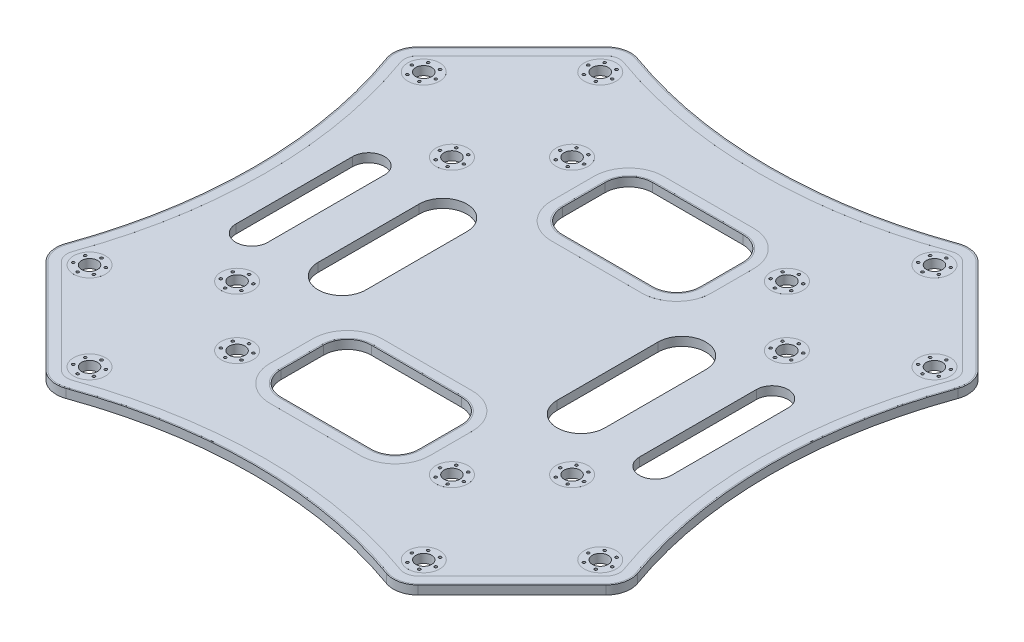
from build123d import *

# Parameters (mm, degrees)
BOSS_EXTRUDE1_DEPTH      = 0.825
BOSS_EXTRUDE1_DEPTH_BACK = 0.825
CUT_EXTRUDE1_DEPTH       = 1.65
SKETCH3_R                = 1.5
CUT_EXTRUDE2_DEPTH       = 1.65
BOSS_EXTRUDE2_START      = 0.001
SKETCH4_R                = 3
SKETCH4_R_2              = 0.25
SKETCH4_R_3              = 1.5
BOSS_EXTRUDE2_DEPTH      = 0.001
SKETCH5_R                = 0.25
CUT_EXTRUDE3_DEPTH       = 1.65


with BuildPart() as part:
    # Sketch1 → Boss-Extrude1 (new, two sides: drawn at the far end of the back side and taken through both)
    with BuildSketch(Plane(origin=(0, 0, 0), x_dir=(1, 0, 0), z_dir=(0, 1, 0)).offset(-BOSS_EXTRUDE1_DEPTH_BACK)):
        with BuildLine():
            Line((35.046361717, 52.705589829), (52.705589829, 35.046361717))
            ThreePointArc((52.705589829, 35.046361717), (53.961944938, 32.762265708), (53.8, 30.160478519))
            ThreePointArc((53.8, 30.160478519), (48.55, 0), (53.8, -30.160478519))
            ThreePointArc((53.8, -30.160478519), (53.961944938, -32.762265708), (52.705589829, -35.046361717))
            Line((52.705589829, -35.046361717), (35.046361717, -52.705589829))
            ThreePointArc((35.046361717, -52.705589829), (32.762265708, -53.961944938), (30.160478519, -53.8))
            ThreePointArc((30.160478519, -53.8), (0, -48.55), (-30.160478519, -53.8))
            ThreePointArc((-30.160478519, -53.8), (-32.762265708, -53.961944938), (-35.046361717, -52.705589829))
            Line((-35.046361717, -52.705589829), (-52.705589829, -35.046361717))
            ThreePointArc((-52.705589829, -35.046361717), (-53.961944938, -32.762265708), (-53.8, -30.160478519))
            ThreePointArc((-53.8, -30.160478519), (-48.55, 0), (-53.8, 30.160478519))
            ThreePointArc((-53.8, 30.160478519), (-53.961944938, 32.762265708), (-52.705589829, 35.046361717))
            Line((-52.705589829, 35.046361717), (-35.046361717, 52.705589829))
            ThreePointArc((-35.046361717, 52.705589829), (-32.762265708, 53.961944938), (-30.160478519, 53.8))
            ThreePointArc((-30.160478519, 53.8), (0, 48.55), (30.160478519, 53.8))
            ThreePointArc((30.160478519, 53.8), (32.762265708, 53.961944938), (35.046361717, 52.705589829))
        make_face()
    extrude(amount=BOSS_EXTRUDE1_DEPTH + BOSS_EXTRUDE1_DEPTH_BACK)

    # Sketch2 → Cut-Extrude1 (cut)
    with BuildSketch(Plane(origin=(0, 0.825, 0), x_dir=(1, 0, 0), z_dir=(0, 1, 0))):
        with BuildLine():
            Line((13, 30.5), (13, 22.5))
            ThreePointArc((13, 22.5), (11.681980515, 19.318019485), (8.5, 18))
            Line((8.5, 18), (-8.5, 18))
            ThreePointArc((-8.5, 18), (-11.681980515, 19.318019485), (-13, 22.5))
            Line((-13, 22.5), (-13, 30.5))
            ThreePointArc((-13, 30.5), (-11.681980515, 33.681980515), (-8.5, 35))
            Line((-8.5, 35), (8.5, 35))
            ThreePointArc((8.5, 35), (11.681980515, 33.681980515), (13, 30.5))
        make_face()
        with BuildLine():
            Line((-13, -22.5), (-13, -30.5))
            ThreePointArc((-13, -30.5), (-11.681980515, -33.681980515), (-8.5, -35))
            Line((-8.5, -35), (8.5, -35))
            ThreePointArc((8.5, -35), (11.681980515, -33.681980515), (13, -30.5))
            Line((13, -30.5), (13, -22.5))
            ThreePointArc((13, -22.5), (11.681980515, -19.318019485), (8.5, -18))
            Line((8.5, -18), (-8.5, -18))
            ThreePointArc((-8.5, -18), (-11.681980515, -19.318019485), (-13, -22.5))
        make_face()
        with BuildLine():
            Line((-27, -9.5), (-27, 9.5))
            ThreePointArc((-27, 9.5), (-22.5, 14), (-18, 9.5))
            Line((-18, 9.5), (-18, -9.5))
            ThreePointArc((-18, -9.5), (-22.5, -14), (-27, -9.5))
        make_face()
        with BuildLine():
            Line((18, -9.5), (18, 9.5))
            ThreePointArc((18, 9.5), (22.5, 14), (27, 9.5))
            Line((27, 9.5), (27, -9.5))
            ThreePointArc((27, -9.5), (22.5, -14), (18, -9.5))
        make_face()
        with BuildLine():
            Line((-35, 11), (-35, -11))
            ThreePointArc((-35, -11), (-38, -14), (-41, -11))
            Line((-41, -11), (-41, 11))
            ThreePointArc((-41, 11), (-38, 14), (-35, 11))
        make_face()
        with BuildLine():
            Line((35, 11), (35, -11))
            ThreePointArc((35, -11), (38, -14), (41, -11))
            Line((41, -11), (41, 11))
            ThreePointArc((41, 11), (38, 14), (35, 11))
        make_face()
    extrude(amount=-CUT_EXTRUDE1_DEPTH, mode=Mode.SUBTRACT)

    # Sketch3 → Cut-Extrude2 (cut)
    with BuildSketch(Plane(origin=(0, 0.825, 0), x_dir=(1, 0, 0), z_dir=(0, 1, 0))):
        with Locations(Location((-48.083261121, -31.466251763, 0), (0, 0, 270))):
            Circle(SKETCH3_R)
        with Locations(Location((-31.466251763, -48.083261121, 0), (0, 0, 270))):
            Circle(SKETCH3_R)
        with Locations(Location((31.466251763, -48.083261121, 0), (0, 0, 270))):
            Circle(SKETCH3_R)
        with Locations(Location((48.083261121, -31.466251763, 0), (0, 0, 270))):
            Circle(SKETCH3_R)
        with Locations(Location((48.083261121, 31.466251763, 0), (0, 0, 270))):
            Circle(SKETCH3_R)
        with Locations(Location((31.466251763, 48.083261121, 0), (0, 0, 270))):
            Circle(SKETCH3_R)
        with Locations(Location((-31.466251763, 48.083261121, 0), (0, 0, 270))):
            Circle(SKETCH3_R)
        with Locations(Location((-48.083261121, 31.466251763, 0), (0, 0, 270))):
            Circle(SKETCH3_R)
        with Locations(Location((-31.540291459, -20.22658296, 0), (0, 0, 270))):
            Circle(SKETCH3_R)
        with Locations(Location((-20.22658296, -31.540291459, 0), (0, 0, 270))):
            Circle(SKETCH3_R)
        with Locations(Location((-31.540291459, 20.22658296, 0), (0, 0, 270))):
            Circle(SKETCH3_R)
        with Locations(Location((-20.22658296, 31.540291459, 0), (0, 0, 270))):
            Circle(SKETCH3_R)
        with Locations(Location((20.22658296, 31.540291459, 0), (0, 0, 270))):
            Circle(SKETCH3_R)
        with Locations(Location((31.540291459, 20.22658296, 0), (0, 0, 270))):
            Circle(SKETCH3_R)
        with Locations(Location((31.540291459, -20.22658296, 0), (0, 0, 270))):
            Circle(SKETCH3_R)
        with Locations(Location((20.22658296, -31.540291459, 0), (0, 0, 270))):
            Circle(SKETCH3_R)
    extrude(amount=-CUT_EXTRUDE2_DEPTH, mode=Mode.SUBTRACT)

    # Sketch4 → Boss-Extrude2 (add)
    # profile 1 of 19: a face of its own
    with BuildSketch(Plane(origin=(0, 0.825, 0), x_dir=(1, 0, 0), z_dir=(0, 1, 0)).offset(BOSS_EXTRUDE2_START)):
        with BuildLine():
            ThreePointArc((30.244953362, -53.564704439), (32.707621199, -53.71799007), (34.869585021, -52.528813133))
            Line((34.869585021, -52.528813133), (52.528813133, -34.869585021))
            ThreePointArc((52.528813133, -34.869585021), (53.71799007, -32.707621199), (53.564704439, -30.244953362))
            ThreePointArc((53.564704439, -30.244953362), (48.3, 0), (53.564704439, 30.244953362))
            ThreePointArc((53.564704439, 30.244953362), (53.71799007, 32.707621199), (52.528813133, 34.869585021))
            Line((52.528813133, 34.869585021), (34.869585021, 52.528813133))
            ThreePointArc((34.869585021, 52.528813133), (32.707621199, 53.71799007), (30.244953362, 53.564704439))
            ThreePointArc((30.244953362, 53.564704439), (0, 48.3), (-30.244953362, 53.564704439))
            ThreePointArc((-30.244953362, 53.564704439), (-32.707621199, 53.71799007), (-34.869585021, 52.528813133))
            Line((-34.869585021, 52.528813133), (-52.528813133, 34.869585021))
            ThreePointArc((-52.528813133, 34.869585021), (-53.71799007, 32.707621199), (-53.564704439, 30.244953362))
            ThreePointArc((-53.564704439, 30.244953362), (-48.3, 0), (-53.564704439, -30.244953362))
            ThreePointArc((-53.564704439, -30.244953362), (-53.71799007, -32.707621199), (-52.528813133, -34.869585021))
            Line((-52.528813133, -34.869585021), (-34.869585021, -52.528813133))
            ThreePointArc((-34.869585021, -52.528813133), (-32.707621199, -53.71799007), (-30.244953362, -53.564704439))
            ThreePointArc((-30.244953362, -53.564704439), (0, -48.3), (30.244953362, -53.564704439))
        make_face()
        with BuildLine():
            ThreePointArc((-51.870576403, 30.853172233), (-51.961515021, 32.314180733), (-51.256020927, 33.596792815))
            Line((-51.256020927, 33.596792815), (-33.596792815, 51.256020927))
            ThreePointArc((-33.596792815, 51.256020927), (-32.314180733, 51.961515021), (-30.853172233, 51.870576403))
            ThreePointArc((-30.853172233, 51.870576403), (0, 46.5), (30.853172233, 51.870576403))
            ThreePointArc((30.853172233, 51.870576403), (32.314180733, 51.961515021), (33.596792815, 51.256020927))
            Line((33.596792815, 51.256020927), (51.256020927, 33.596792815))
            ThreePointArc((51.256020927, 33.596792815), (51.961515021, 32.314180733), (51.870576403, 30.853172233))
            ThreePointArc((51.870576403, 30.853172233), (46.5, 0), (51.870576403, -30.853172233))
            ThreePointArc((51.870576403, -30.853172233), (51.961515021, -32.314180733), (51.256020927, -33.596792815))
            Line((51.256020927, -33.596792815), (33.596792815, -51.256020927))
            ThreePointArc((33.596792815, -51.256020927), (32.314180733, -51.961515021), (30.853172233, -51.870576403))
            ThreePointArc((30.853172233, -51.870576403), (0, -46.5), (-30.853172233, -51.870576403))
            ThreePointArc((-30.853172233, -51.870576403), (-32.314180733, -51.961515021), (-33.596792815, -51.256020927))
            Line((-33.596792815, -51.256020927), (-51.256020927, -33.596792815))
            ThreePointArc((-51.256020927, -33.596792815), (-51.961515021, -32.314180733), (-51.870576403, -30.853172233))
            ThreePointArc((-51.870576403, -30.853172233), (-46.5, 0), (-51.870576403, 30.853172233))
        make_face(mode=Mode.SUBTRACT)
    # profile 2 of 19: a face of its own
    with BuildSketch(Plane(origin=(0, 0.825, 0), x_dir=(1, 0, 0), z_dir=(0, 1, 0)).offset(BOSS_EXTRUDE2_START)):
        with BuildLine():
            Line((15.05, 22.5), (15.05, 30.5))
            ThreePointArc((15.05, 30.5), (13.131549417, 35.131549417), (8.5, 37.05))
            Line((8.5, 37.05), (-8.5, 37.05))
            ThreePointArc((-8.5, 37.05), (-13.131549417, 35.131549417), (-15.05, 30.5))
            Line((-15.05, 30.5), (-15.05, 22.5))
            ThreePointArc((-15.05, 22.5), (-13.131549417, 17.868450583), (-8.5, 15.95))
            Line((-8.5, 15.95), (8.5, 15.95))
            ThreePointArc((8.5, 15.95), (13.131549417, 17.868450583), (15.05, 22.5))
        make_face()
        with BuildLine():
            Line((8.5, 17.75), (-8.5, 17.75))
            ThreePointArc((-8.5, 17.75), (-11.858757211, 19.141242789), (-13.25, 22.5))
            Line((-13.25, 22.5), (-13.25, 30.5))
            ThreePointArc((-13.25, 30.5), (-11.858757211, 33.858757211), (-8.5, 35.25))
            Line((-8.5, 35.25), (8.5, 35.25))
            ThreePointArc((8.5, 35.25), (11.858757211, 33.858757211), (13.25, 30.5))
            Line((13.25, 30.5), (13.25, 22.5))
            ThreePointArc((13.25, 22.5), (11.858757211, 19.141242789), (8.5, 17.75))
        make_face(mode=Mode.SUBTRACT)
    # profile 3 of 19: a face of its own
    with BuildSketch(Plane(origin=(0, 0.825, 0), x_dir=(1, 0, 0), z_dir=(0, 1, 0)).offset(BOSS_EXTRUDE2_START)):
        with BuildLine():
            ThreePointArc((8.5, -37.05), (13.131549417, -35.131549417), (15.05, -30.5))
            Line((15.05, -30.5), (15.05, -22.5))
            ThreePointArc((15.05, -22.5), (13.131549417, -17.868450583), (8.5, -15.95))
            Line((8.5, -15.95), (-8.5, -15.95))
            ThreePointArc((-8.5, -15.95), (-13.131549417, -17.868450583), (-15.05, -22.5))
            Line((-15.05, -22.5), (-15.05, -30.5))
            ThreePointArc((-15.05, -30.5), (-13.131549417, -35.131549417), (-8.5, -37.05))
            Line((-8.5, -37.05), (8.5, -37.05))
        make_face()
        with BuildLine():
            Line((13.25, -22.5), (13.25, -30.5))
            ThreePointArc((13.25, -30.5), (11.858757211, -33.858757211), (8.5, -35.25))
            Line((8.5, -35.25), (-8.5, -35.25))
            ThreePointArc((-8.5, -35.25), (-11.858757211, -33.858757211), (-13.25, -30.5))
            Line((-13.25, -30.5), (-13.25, -22.5))
            ThreePointArc((-13.25, -22.5), (-11.858757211, -19.141242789), (-8.5, -17.75))
            Line((-8.5, -17.75), (8.5, -17.75))
            ThreePointArc((8.5, -17.75), (11.858757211, -19.141242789), (13.25, -22.5))
        make_face(mode=Mode.SUBTRACT)
    # profile 4 of 19: a face of its own
    with BuildSketch(Plane(origin=(0, 0.825, 0), x_dir=(1, 0, 0), z_dir=(0, 1, 0)).offset(BOSS_EXTRUDE2_START)):
        with Locations(Location((-31.466251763, -48.083261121, 0), (0, 0, 270))):
            Circle(SKETCH4_R)
        with Locations(Location((-33.414808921, -49.208261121, 0), (0, 0, 270))):
            Circle(SKETCH4_R_2, mode=Mode.SUBTRACT)
        with Locations(Location((-31.466251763, -50.333261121, 0), (0, 0, 270))):
            Circle(SKETCH4_R_2, mode=Mode.SUBTRACT)
        with Locations(Location((-31.466251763, -48.083261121, 0), (0, 0, 270))):
            Circle(SKETCH4_R_3, mode=Mode.SUBTRACT)
        with Locations(Location((-29.517694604, -49.208261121, 0), (0, 0, 270))):
            Circle(SKETCH4_R_2, mode=Mode.SUBTRACT)
        with Locations(Location((-33.414808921, -46.958261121, 0), (0, 0, 270))):
            Circle(SKETCH4_R_2, mode=Mode.SUBTRACT)
        with Locations(Location((-31.466251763, -45.833261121, 0), (0, 0, 270))):
            Circle(SKETCH4_R_2, mode=Mode.SUBTRACT)
        with Locations(Location((-29.517694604, -46.958261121, 0), (0, 0, 270))):
            Circle(SKETCH4_R_2, mode=Mode.SUBTRACT)
    # profile 5 of 19: a face of its own
    with BuildSketch(Plane(origin=(0, 0.825, 0), x_dir=(1, 0, 0), z_dir=(0, 1, 0)).offset(BOSS_EXTRUDE2_START)):
        with Locations(Location((-48.083261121, -31.466251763, 0), (0, 0, 270))):
            Circle(SKETCH4_R)
        with Locations(Location((-48.083261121, -33.716251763, 0), (0, 0, 270))):
            Circle(SKETCH4_R_2, mode=Mode.SUBTRACT)
        with Locations(Location((-50.031818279, -32.591251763, 0), (0, 0, 270))):
            Circle(SKETCH4_R_2, mode=Mode.SUBTRACT)
        with Locations(Location((-50.031818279, -30.341251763, 0), (0, 0, 270))):
            Circle(SKETCH4_R_2, mode=Mode.SUBTRACT)
        with Locations(Location((-48.083261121, -31.466251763, 0), (0, 0, 270))):
            Circle(SKETCH4_R_3, mode=Mode.SUBTRACT)
        with Locations(Location((-48.083261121, -29.216251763, 0), (0, 0, 270))):
            Circle(SKETCH4_R_2, mode=Mode.SUBTRACT)
        with Locations(Location((-46.134703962, -32.591251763, 0), (0, 0, 270))):
            Circle(SKETCH4_R_2, mode=Mode.SUBTRACT)
        with Locations(Location((-46.134703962, -30.341251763, 0), (0, 0, 270))):
            Circle(SKETCH4_R_2, mode=Mode.SUBTRACT)
    # profile 6 of 19: a face of its own
    with BuildSketch(Plane(origin=(0, 0.825, 0), x_dir=(1, 0, 0), z_dir=(0, 1, 0)).offset(BOSS_EXTRUDE2_START)):
        with Locations(Location((-31.540291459, -20.22658296, 0), (0, 0, 270))):
            Circle(SKETCH4_R)
        with Locations(Location((-31.540291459, -22.47658296, 0), (0, 0, 270))):
            Circle(SKETCH4_R_2, mode=Mode.SUBTRACT)
        with Locations(Location((-33.488848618, -21.35158296, 0), (0, 0, 270))):
            Circle(SKETCH4_R_2, mode=Mode.SUBTRACT)
        with Locations(Location((-31.540291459, -20.22658296, 0), (0, 0, 270))):
            Circle(SKETCH4_R_3, mode=Mode.SUBTRACT)
        with Locations(Location((-29.591734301, -21.35158296, 0), (0, 0, 270))):
            Circle(SKETCH4_R_2, mode=Mode.SUBTRACT)
        with Locations(Location((-33.488848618, -19.10158296, 0), (0, 0, 270))):
            Circle(SKETCH4_R_2, mode=Mode.SUBTRACT)
        with Locations(Location((-31.540291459, -17.97658296, 0), (0, 0, 270))):
            Circle(SKETCH4_R_2, mode=Mode.SUBTRACT)
        with Locations(Location((-29.591734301, -19.10158296, 0), (0, 0, 270))):
            Circle(SKETCH4_R_2, mode=Mode.SUBTRACT)
    # profile 7 of 19: a face of its own
    with BuildSketch(Plane(origin=(0, 0.825, 0), x_dir=(1, 0, 0), z_dir=(0, 1, 0)).offset(BOSS_EXTRUDE2_START)):
        with Locations(Location((-20.22658296, -31.540291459, 0), (0, 0, 270))):
            Circle(SKETCH4_R)
        with Locations(Location((-20.22658296, -33.790291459, 0), (0, 0, 270))):
            Circle(SKETCH4_R_2, mode=Mode.SUBTRACT)
        with Locations(Location((-22.175140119, -32.665291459, 0), (0, 0, 270))):
            Circle(SKETCH4_R_2, mode=Mode.SUBTRACT)
        with Locations(Location((-22.175140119, -30.415291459, 0), (0, 0, 270))):
            Circle(SKETCH4_R_2, mode=Mode.SUBTRACT)
        with Locations(Location((-20.22658296, -31.540291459, 0), (0, 0, 270))):
            Circle(SKETCH4_R_3, mode=Mode.SUBTRACT)
        with Locations(Location((-20.22658296, -29.290291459, 0), (0, 0, 270))):
            Circle(SKETCH4_R_2, mode=Mode.SUBTRACT)
        with Locations(Location((-18.278025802, -32.665291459, 0), (0, 0, 270))):
            Circle(SKETCH4_R_2, mode=Mode.SUBTRACT)
        with Locations(Location((-18.278025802, -30.415291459, 0), (0, 0, 270))):
            Circle(SKETCH4_R_2, mode=Mode.SUBTRACT)
    # profile 8 of 19: a face of its own
    with BuildSketch(Plane(origin=(0, 0.825, 0), x_dir=(1, 0, 0), z_dir=(0, 1, 0)).offset(BOSS_EXTRUDE2_START)):
        with Locations(Location((-48.083261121, 31.466251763, 0), (0, 0, 270))):
            Circle(SKETCH4_R)
        with Locations(Location((-49.208261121, 29.517694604, 0), (0, 0, 270))):
            Circle(SKETCH4_R_2, mode=Mode.SUBTRACT)
        with Locations(Location((-50.333261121, 31.466251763, 0), (0, 0, 270))):
            Circle(SKETCH4_R_2, mode=Mode.SUBTRACT)
        with Locations(Location((-48.083261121, 31.466251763, 0), (0, 0, 270))):
            Circle(SKETCH4_R_3, mode=Mode.SUBTRACT)
        with Locations(Location((-49.208261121, 33.414808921, 0), (0, 0, 270))):
            Circle(SKETCH4_R_2, mode=Mode.SUBTRACT)
        with Locations(Location((-46.958261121, 29.517694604, 0), (0, 0, 270))):
            Circle(SKETCH4_R_2, mode=Mode.SUBTRACT)
        with Locations(Location((-45.833261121, 31.466251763, 0), (0, 0, 270))):
            Circle(SKETCH4_R_2, mode=Mode.SUBTRACT)
        with Locations(Location((-46.958261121, 33.414808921, 0), (0, 0, 270))):
            Circle(SKETCH4_R_2, mode=Mode.SUBTRACT)
    # profile 9 of 19: a face of its own
    with BuildSketch(Plane(origin=(0, 0.825, 0), x_dir=(1, 0, 0), z_dir=(0, 1, 0)).offset(BOSS_EXTRUDE2_START)):
        with Locations(Location((-31.540291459, 20.22658296, 0), (0, 0, 270))):
            Circle(SKETCH4_R)
        with Locations(Location((-32.665291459, 18.278025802, 0), (0, 0, 270))):
            Circle(SKETCH4_R_2, mode=Mode.SUBTRACT)
        with Locations(Location((-30.415291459, 18.278025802, 0), (0, 0, 270))):
            Circle(SKETCH4_R_2, mode=Mode.SUBTRACT)
        with Locations(Location((-33.790291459, 20.22658296, 0), (0, 0, 270))):
            Circle(SKETCH4_R_2, mode=Mode.SUBTRACT)
        with Locations(Location((-31.540291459, 20.22658296, 0), (0, 0, 270))):
            Circle(SKETCH4_R_3, mode=Mode.SUBTRACT)
        with Locations(Location((-32.665291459, 22.175140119, 0), (0, 0, 270))):
            Circle(SKETCH4_R_2, mode=Mode.SUBTRACT)
        with Locations(Location((-30.415291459, 22.175140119, 0), (0, 0, 270))):
            Circle(SKETCH4_R_2, mode=Mode.SUBTRACT)
        with Locations(Location((-29.290291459, 20.22658296, 0), (0, 0, 270))):
            Circle(SKETCH4_R_2, mode=Mode.SUBTRACT)
    # profile 10 of 19: a face of its own
    with BuildSketch(Plane(origin=(0, 0.825, 0), x_dir=(1, 0, 0), z_dir=(0, 1, 0)).offset(BOSS_EXTRUDE2_START)):
        with Locations(Location((-20.22658296, 31.540291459, 0), (0, 0, 270))):
            Circle(SKETCH4_R)
        with Locations(Location((-21.35158296, 29.591734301, 0), (0, 0, 270))):
            Circle(SKETCH4_R_2, mode=Mode.SUBTRACT)
        with Locations(Location((-22.47658296, 31.540291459, 0), (0, 0, 270))):
            Circle(SKETCH4_R_2, mode=Mode.SUBTRACT)
        with Locations(Location((-20.22658296, 31.540291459, 0), (0, 0, 270))):
            Circle(SKETCH4_R_3, mode=Mode.SUBTRACT)
        with Locations(Location((-21.35158296, 33.488848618, 0), (0, 0, 270))):
            Circle(SKETCH4_R_2, mode=Mode.SUBTRACT)
        with Locations(Location((-19.10158296, 29.591734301, 0), (0, 0, 270))):
            Circle(SKETCH4_R_2, mode=Mode.SUBTRACT)
        with Locations(Location((-17.97658296, 31.540291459, 0), (0, 0, 270))):
            Circle(SKETCH4_R_2, mode=Mode.SUBTRACT)
        with Locations(Location((-19.10158296, 33.488848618, 0), (0, 0, 270))):
            Circle(SKETCH4_R_2, mode=Mode.SUBTRACT)
    # profile 11 of 19: a face of its own
    with BuildSketch(Plane(origin=(0, 0.825, 0), x_dir=(1, 0, 0), z_dir=(0, 1, 0)).offset(BOSS_EXTRUDE2_START)):
        with Locations(Location((-31.466251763, 48.083261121, 0), (0, 0, 270))):
            Circle(SKETCH4_R)
        with Locations(Location((-32.591251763, 46.134703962, 0), (0, 0, 270))):
            Circle(SKETCH4_R_2, mode=Mode.SUBTRACT)
        with Locations(Location((-30.341251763, 46.134703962, 0), (0, 0, 270))):
            Circle(SKETCH4_R_2, mode=Mode.SUBTRACT)
        with Locations(Location((-33.716251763, 48.083261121, 0), (0, 0, 270))):
            Circle(SKETCH4_R_2, mode=Mode.SUBTRACT)
        with Locations(Location((-31.466251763, 48.083261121, 0), (0, 0, 270))):
            Circle(SKETCH4_R_3, mode=Mode.SUBTRACT)
        with Locations(Location((-32.591251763, 50.031818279, 0), (0, 0, 270))):
            Circle(SKETCH4_R_2, mode=Mode.SUBTRACT)
        with Locations(Location((-30.341251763, 50.031818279, 0), (0, 0, 270))):
            Circle(SKETCH4_R_2, mode=Mode.SUBTRACT)
        with Locations(Location((-29.216251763, 48.083261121, 0), (0, 0, 270))):
            Circle(SKETCH4_R_2, mode=Mode.SUBTRACT)
    # profile 12 of 19: a face of its own
    with BuildSketch(Plane(origin=(0, 0.825, 0), x_dir=(1, 0, 0), z_dir=(0, 1, 0)).offset(BOSS_EXTRUDE2_START)):
        with Locations(Location((20.22658296, 31.540291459, 0), (0, 0, 270))):
            Circle(SKETCH4_R)
        with Locations(Location((18.278025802, 30.415291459, 0), (0, 0, 270))):
            Circle(SKETCH4_R_2, mode=Mode.SUBTRACT)
        with Locations(Location((18.278025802, 32.665291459, 0), (0, 0, 270))):
            Circle(SKETCH4_R_2, mode=Mode.SUBTRACT)
        with Locations(Location((20.22658296, 29.290291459, 0), (0, 0, 270))):
            Circle(SKETCH4_R_2, mode=Mode.SUBTRACT)
        with Locations(Location((20.22658296, 31.540291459, 0), (0, 0, 270))):
            Circle(SKETCH4_R_3, mode=Mode.SUBTRACT)
        with Locations(Location((22.175140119, 30.415291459, 0), (0, 0, 270))):
            Circle(SKETCH4_R_2, mode=Mode.SUBTRACT)
        with Locations(Location((22.175140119, 32.665291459, 0), (0, 0, 270))):
            Circle(SKETCH4_R_2, mode=Mode.SUBTRACT)
        with Locations(Location((20.22658296, 33.790291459, 0), (0, 0, 270))):
            Circle(SKETCH4_R_2, mode=Mode.SUBTRACT)
    # profile 13 of 19: a face of its own
    with BuildSketch(Plane(origin=(0, 0.825, 0), x_dir=(1, 0, 0), z_dir=(0, 1, 0)).offset(BOSS_EXTRUDE2_START)):
        with Locations(Location((31.466251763, 48.083261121, 0), (0, 0, 270))):
            Circle(SKETCH4_R)
        with Locations(Location((29.517694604, 46.958261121, 0), (0, 0, 270))):
            Circle(SKETCH4_R_2, mode=Mode.SUBTRACT)
        with Locations(Location((31.466251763, 45.833261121, 0), (0, 0, 270))):
            Circle(SKETCH4_R_2, mode=Mode.SUBTRACT)
        with Locations(Location((33.414808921, 46.958261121, 0), (0, 0, 270))):
            Circle(SKETCH4_R_2, mode=Mode.SUBTRACT)
        with Locations(Location((29.517694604, 49.208261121, 0), (0, 0, 270))):
            Circle(SKETCH4_R_2, mode=Mode.SUBTRACT)
        with Locations(Location((31.466251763, 48.083261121, 0), (0, 0, 270))):
            Circle(SKETCH4_R_3, mode=Mode.SUBTRACT)
        with Locations(Location((31.466251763, 50.333261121, 0), (0, 0, 270))):
            Circle(SKETCH4_R_2, mode=Mode.SUBTRACT)
        with Locations(Location((33.414808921, 49.208261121, 0), (0, 0, 270))):
            Circle(SKETCH4_R_2, mode=Mode.SUBTRACT)
    # profile 14 of 19: a face of its own
    with BuildSketch(Plane(origin=(0, 0.825, 0), x_dir=(1, 0, 0), z_dir=(0, 1, 0)).offset(BOSS_EXTRUDE2_START)):
        with Locations(Location((48.083261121, 31.466251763, 0), (0, 0, 270))):
            Circle(SKETCH4_R)
        with Locations(Location((46.134703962, 30.341251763, 0), (0, 0, 270))):
            Circle(SKETCH4_R_2, mode=Mode.SUBTRACT)
        with Locations(Location((46.134703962, 32.591251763, 0), (0, 0, 270))):
            Circle(SKETCH4_R_2, mode=Mode.SUBTRACT)
        with Locations(Location((48.083261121, 29.216251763, 0), (0, 0, 270))):
            Circle(SKETCH4_R_2, mode=Mode.SUBTRACT)
        with Locations(Location((48.083261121, 31.466251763, 0), (0, 0, 270))):
            Circle(SKETCH4_R_3, mode=Mode.SUBTRACT)
        with Locations(Location((50.031818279, 30.341251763, 0), (0, 0, 270))):
            Circle(SKETCH4_R_2, mode=Mode.SUBTRACT)
        with Locations(Location((50.031818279, 32.591251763, 0), (0, 0, 270))):
            Circle(SKETCH4_R_2, mode=Mode.SUBTRACT)
        with Locations(Location((48.083261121, 33.716251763, 0), (0, 0, 270))):
            Circle(SKETCH4_R_2, mode=Mode.SUBTRACT)
    # profile 15 of 19: a face of its own
    with BuildSketch(Plane(origin=(0, 0.825, 0), x_dir=(1, 0, 0), z_dir=(0, 1, 0)).offset(BOSS_EXTRUDE2_START)):
        with Locations(Location((31.540291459, 20.22658296, 0), (0, 0, 270))):
            Circle(SKETCH4_R)
        with Locations(Location((29.591734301, 19.10158296, 0), (0, 0, 270))):
            Circle(SKETCH4_R_2, mode=Mode.SUBTRACT)
        with Locations(Location((31.540291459, 17.97658296, 0), (0, 0, 270))):
            Circle(SKETCH4_R_2, mode=Mode.SUBTRACT)
        with Locations(Location((33.488848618, 19.10158296, 0), (0, 0, 270))):
            Circle(SKETCH4_R_2, mode=Mode.SUBTRACT)
        with Locations(Location((29.591734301, 21.35158296, 0), (0, 0, 270))):
            Circle(SKETCH4_R_2, mode=Mode.SUBTRACT)
        with Locations(Location((31.540291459, 20.22658296, 0), (0, 0, 270))):
            Circle(SKETCH4_R_3, mode=Mode.SUBTRACT)
        with Locations(Location((33.488848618, 21.35158296, 0), (0, 0, 270))):
            Circle(SKETCH4_R_2, mode=Mode.SUBTRACT)
        with Locations(Location((31.540291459, 22.47658296, 0), (0, 0, 270))):
            Circle(SKETCH4_R_2, mode=Mode.SUBTRACT)
    # profile 16 of 19: a face of its own
    with BuildSketch(Plane(origin=(0, 0.825, 0), x_dir=(1, 0, 0), z_dir=(0, 1, 0)).offset(BOSS_EXTRUDE2_START)):
        with Locations(Location((20.22658296, -31.540291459, 0), (0, 0, 270))):
            Circle(SKETCH4_R)
        with Locations(Location((19.10158296, -33.488848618, 0), (0, 0, 270))):
            Circle(SKETCH4_R_2, mode=Mode.SUBTRACT)
        with Locations(Location((17.97658296, -31.540291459, 0), (0, 0, 270))):
            Circle(SKETCH4_R_2, mode=Mode.SUBTRACT)
        with Locations(Location((19.10158296, -29.591734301, 0), (0, 0, 270))):
            Circle(SKETCH4_R_2, mode=Mode.SUBTRACT)
        with Locations(Location((21.35158296, -33.488848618, 0), (0, 0, 270))):
            Circle(SKETCH4_R_2, mode=Mode.SUBTRACT)
        with Locations(Location((20.22658296, -31.540291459, 0), (0, 0, 270))):
            Circle(SKETCH4_R_3, mode=Mode.SUBTRACT)
        with Locations(Location((22.47658296, -31.540291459, 0), (0, 0, 270))):
            Circle(SKETCH4_R_2, mode=Mode.SUBTRACT)
        with Locations(Location((21.35158296, -29.591734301, 0), (0, 0, 270))):
            Circle(SKETCH4_R_2, mode=Mode.SUBTRACT)
    # profile 17 of 19: a face of its own
    with BuildSketch(Plane(origin=(0, 0.825, 0), x_dir=(1, 0, 0), z_dir=(0, 1, 0)).offset(BOSS_EXTRUDE2_START)):
        with Locations(Location((31.540291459, -20.22658296, 0), (0, 0, 270))):
            Circle(SKETCH4_R)
        with Locations(Location((29.290291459, -20.22658296, 0), (0, 0, 270))):
            Circle(SKETCH4_R_2, mode=Mode.SUBTRACT)
        with Locations(Location((30.415291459, -22.175140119, 0), (0, 0, 270))):
            Circle(SKETCH4_R_2, mode=Mode.SUBTRACT)
        with Locations(Location((32.665291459, -22.175140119, 0), (0, 0, 270))):
            Circle(SKETCH4_R_2, mode=Mode.SUBTRACT)
        with Locations(Location((31.540291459, -20.22658296, 0), (0, 0, 270))):
            Circle(SKETCH4_R_3, mode=Mode.SUBTRACT)
        with Locations(Location((33.790291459, -20.22658296, 0), (0, 0, 270))):
            Circle(SKETCH4_R_2, mode=Mode.SUBTRACT)
        with Locations(Location((30.415291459, -18.278025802, 0), (0, 0, 270))):
            Circle(SKETCH4_R_2, mode=Mode.SUBTRACT)
        with Locations(Location((32.665291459, -18.278025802, 0), (0, 0, 270))):
            Circle(SKETCH4_R_2, mode=Mode.SUBTRACT)
    # profile 18 of 19: a face of its own
    with BuildSketch(Plane(origin=(0, 0.825, 0), x_dir=(1, 0, 0), z_dir=(0, 1, 0)).offset(BOSS_EXTRUDE2_START)):
        with Locations(Location((48.083261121, -31.466251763, 0), (0, 0, 270))):
            Circle(SKETCH4_R)
        with Locations(Location((46.958261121, -33.414808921, 0), (0, 0, 270))):
            Circle(SKETCH4_R_2, mode=Mode.SUBTRACT)
        with Locations(Location((45.833261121, -31.466251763, 0), (0, 0, 270))):
            Circle(SKETCH4_R_2, mode=Mode.SUBTRACT)
        with Locations(Location((46.958261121, -29.517694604, 0), (0, 0, 270))):
            Circle(SKETCH4_R_2, mode=Mode.SUBTRACT)
        with Locations(Location((49.208261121, -33.414808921, 0), (0, 0, 270))):
            Circle(SKETCH4_R_2, mode=Mode.SUBTRACT)
        with Locations(Location((48.083261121, -31.466251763, 0), (0, 0, 270))):
            Circle(SKETCH4_R_3, mode=Mode.SUBTRACT)
        with Locations(Location((50.333261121, -31.466251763, 0), (0, 0, 270))):
            Circle(SKETCH4_R_2, mode=Mode.SUBTRACT)
        with Locations(Location((49.208261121, -29.517694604, 0), (0, 0, 270))):
            Circle(SKETCH4_R_2, mode=Mode.SUBTRACT)
    # profile 19 of 19: a face of its own
    with BuildSketch(Plane(origin=(0, 0.825, 0), x_dir=(1, 0, 0), z_dir=(0, 1, 0)).offset(BOSS_EXTRUDE2_START)):
        with Locations(Location((31.466251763, -48.083261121, 0), (0, 0, 270))):
            Circle(SKETCH4_R)
        with Locations(Location((29.216251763, -48.083261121, 0), (0, 0, 270))):
            Circle(SKETCH4_R_2, mode=Mode.SUBTRACT)
        with Locations(Location((30.341251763, -50.031818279, 0), (0, 0, 270))):
            Circle(SKETCH4_R_2, mode=Mode.SUBTRACT)
        with Locations(Location((32.591251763, -50.031818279, 0), (0, 0, 270))):
            Circle(SKETCH4_R_2, mode=Mode.SUBTRACT)
        with Locations(Location((31.466251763, -48.083261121, 0), (0, 0, 270))):
            Circle(SKETCH4_R_3, mode=Mode.SUBTRACT)
        with Locations(Location((33.716251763, -48.083261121, 0), (0, 0, 270))):
            Circle(SKETCH4_R_2, mode=Mode.SUBTRACT)
        with Locations(Location((30.341251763, -46.134703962, 0), (0, 0, 270))):
            Circle(SKETCH4_R_2, mode=Mode.SUBTRACT)
        with Locations(Location((32.591251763, -46.134703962, 0), (0, 0, 270))):
            Circle(SKETCH4_R_2, mode=Mode.SUBTRACT)
    boss_extrude2 = extrude(amount=-BOSS_EXTRUDE2_DEPTH)

    # Mirror2: Boss-Extrude2 across plane
    add(boss_extrude2.mirror(Plane.ZX))

    # Sketch5 → Cut-Extrude3 (cut)
    with BuildSketch(Plane(origin=(0, 0.825, 0), x_dir=(1, 0, 0), z_dir=(0, 1, 0))):
        with Locations(Location((-31.466251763, -45.833261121, 0), (0, 0, 270))):
            Circle(SKETCH5_R)
        with Locations(Location((-29.517694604, -46.958261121, 0), (0, 0, 270))):
            Circle(SKETCH5_R)
        with Locations(Location((-29.517694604, -49.208261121, 0), (0, 0, 270))):
            Circle(SKETCH5_R)
        with Locations(Location((-31.466251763, -50.333261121, 0), (0, 0, 270))):
            Circle(SKETCH5_R)
        with Locations(Location((-33.414808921, -49.208261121, 0), (0, 0, 270))):
            Circle(SKETCH5_R)
        with Locations(Location((-33.414808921, -46.958261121, 0), (0, 0, 270))):
            Circle(SKETCH5_R)
        with Locations(Location((-48.083261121, -33.716251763, 0), (0, 0, 270))):
            Circle(SKETCH5_R)
        with Locations(Location((-50.031818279, -32.591251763, 0), (0, 0, 270))):
            Circle(SKETCH5_R)
        with Locations(Location((-50.031818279, -30.341251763, 0), (0, 0, 270))):
            Circle(SKETCH5_R)
        with Locations(Location((-48.083261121, -29.216251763, 0), (0, 0, 270))):
            Circle(SKETCH5_R)
        with Locations(Location((-46.134703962, -30.341251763, 0), (0, 0, 270))):
            Circle(SKETCH5_R)
        with Locations(Location((-46.134703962, -32.591251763, 0), (0, 0, 270))):
            Circle(SKETCH5_R)
        with Locations(Location((-33.488848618, -21.35158296, 0), (0, 0, 270))):
            Circle(SKETCH5_R)
        with Locations(Location((-33.488848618, -19.10158296, 0), (0, 0, 270))):
            Circle(SKETCH5_R)
        with Locations(Location((-31.540291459, -17.97658296, 0), (0, 0, 270))):
            Circle(SKETCH5_R)
        with Locations(Location((-29.591734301, -19.10158296, 0), (0, 0, 270))):
            Circle(SKETCH5_R)
        with Locations(Location((-29.591734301, -21.35158296, 0), (0, 0, 270))):
            Circle(SKETCH5_R)
        with Locations(Location((-31.540291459, -22.47658296, 0), (0, 0, 270))):
            Circle(SKETCH5_R)
        with Locations(Location((-22.175140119, -30.415291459, 0), (0, 0, 270))):
            Circle(SKETCH5_R)
        with Locations(Location((-22.175140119, -32.665291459, 0), (0, 0, 270))):
            Circle(SKETCH5_R)
        with Locations(Location((-20.22658296, -33.790291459, 0), (0, 0, 270))):
            Circle(SKETCH5_R)
        with Locations(Location((-18.278025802, -32.665291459, 0), (0, 0, 270))):
            Circle(SKETCH5_R)
        with Locations(Location((-18.278025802, -30.415291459, 0), (0, 0, 270))):
            Circle(SKETCH5_R)
        with Locations(Location((-20.22658296, -29.290291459, 0), (0, 0, 270))):
            Circle(SKETCH5_R)
        with Locations(Location((19.10158296, -33.488848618, 0), (0, 0, 270))):
            Circle(SKETCH5_R)
        with Locations(Location((17.97658296, -31.540291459, 0), (0, 0, 270))):
            Circle(SKETCH5_R)
        with Locations(Location((19.10158296, -29.591734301, 0), (0, 0, 270))):
            Circle(SKETCH5_R)
        with Locations(Location((21.35158296, -29.591734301, 0), (0, 0, 270))):
            Circle(SKETCH5_R)
        with Locations(Location((22.47658296, -31.540291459, 0), (0, 0, 270))):
            Circle(SKETCH5_R)
        with Locations(Location((21.35158296, -33.488848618, 0), (0, 0, 270))):
            Circle(SKETCH5_R)
        with Locations(Location((29.290291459, -20.22658296, 0), (0, 0, 270))):
            Circle(SKETCH5_R)
        with Locations(Location((30.415291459, -18.278025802, 0), (0, 0, 270))):
            Circle(SKETCH5_R)
        with Locations(Location((32.665291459, -18.278025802, 0), (0, 0, 270))):
            Circle(SKETCH5_R)
        with Locations(Location((30.415291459, -22.175140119, 0), (0, 0, 270))):
            Circle(SKETCH5_R)
        with Locations(Location((32.665291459, -22.175140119, 0), (0, 0, 270))):
            Circle(SKETCH5_R)
        with Locations(Location((33.790291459, -20.22658296, 0), (0, 0, 270))):
            Circle(SKETCH5_R)
        with Locations(Location((46.958261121, -29.517694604, 0), (0, 0, 270))):
            Circle(SKETCH5_R)
        with Locations(Location((49.208261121, -29.517694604, 0), (0, 0, 270))):
            Circle(SKETCH5_R)
        with Locations(Location((45.833261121, -31.466251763, 0), (0, 0, 270))):
            Circle(SKETCH5_R)
        with Locations(Location((46.958261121, -33.414808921, 0), (0, 0, 270))):
            Circle(SKETCH5_R)
        with Locations(Location((49.208261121, -33.414808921, 0), (0, 0, 270))):
            Circle(SKETCH5_R)
        with Locations(Location((50.333261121, -31.466251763, 0), (0, 0, 270))):
            Circle(SKETCH5_R)
        with Locations(Location((30.341251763, -46.134703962, 0), (0, 0, 270))):
            Circle(SKETCH5_R)
        with Locations(Location((32.591251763, -46.134703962, 0), (0, 0, 270))):
            Circle(SKETCH5_R)
        with Locations(Location((29.216251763, -48.083261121, 0), (0, 0, 270))):
            Circle(SKETCH5_R)
        with Locations(Location((30.341251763, -50.031818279, 0), (0, 0, 270))):
            Circle(SKETCH5_R)
        with Locations(Location((32.591251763, -50.031818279, 0), (0, 0, 270))):
            Circle(SKETCH5_R)
        with Locations(Location((33.716251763, -48.083261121, 0), (0, 0, 270))):
            Circle(SKETCH5_R)
        with Locations(Location((-32.665291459, 18.278025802, 0), (0, 0, 270))):
            Circle(SKETCH5_R)
        with Locations(Location((-33.790291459, 20.22658296, 0), (0, 0, 270))):
            Circle(SKETCH5_R)
        with Locations(Location((-32.665291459, 22.175140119, 0), (0, 0, 270))):
            Circle(SKETCH5_R)
        with Locations(Location((-30.415291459, 22.175140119, 0), (0, 0, 270))):
            Circle(SKETCH5_R)
        with Locations(Location((-29.290291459, 20.22658296, 0), (0, 0, 270))):
            Circle(SKETCH5_R)
        with Locations(Location((-30.415291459, 18.278025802, 0), (0, 0, 270))):
            Circle(SKETCH5_R)
        with Locations(Location((-49.208261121, 29.517694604, 0), (0, 0, 270))):
            Circle(SKETCH5_R)
        with Locations(Location((-50.333261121, 31.466251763, 0), (0, 0, 270))):
            Circle(SKETCH5_R)
        with Locations(Location((-49.208261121, 33.414808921, 0), (0, 0, 270))):
            Circle(SKETCH5_R)
        with Locations(Location((-46.958261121, 33.414808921, 0), (0, 0, 270))):
            Circle(SKETCH5_R)
        with Locations(Location((-45.833261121, 31.466251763, 0), (0, 0, 270))):
            Circle(SKETCH5_R)
        with Locations(Location((-46.958261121, 29.517694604, 0), (0, 0, 270))):
            Circle(SKETCH5_R)
        with Locations(Location((-32.591251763, 46.134703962, 0), (0, 0, 270))):
            Circle(SKETCH5_R)
        with Locations(Location((-33.716251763, 48.083261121, 0), (0, 0, 270))):
            Circle(SKETCH5_R)
        with Locations(Location((-32.591251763, 50.031818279, 0), (0, 0, 270))):
            Circle(SKETCH5_R)
        with Locations(Location((-30.341251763, 50.031818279, 0), (0, 0, 270))):
            Circle(SKETCH5_R)
        with Locations(Location((-29.216251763, 48.083261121, 0), (0, 0, 270))):
            Circle(SKETCH5_R)
        with Locations(Location((-30.341251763, 46.134703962, 0), (0, 0, 270))):
            Circle(SKETCH5_R)
        with Locations(Location((-21.35158296, 29.591734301, 0), (0, 0, 270))):
            Circle(SKETCH5_R)
        with Locations(Location((-22.47658296, 31.540291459, 0), (0, 0, 270))):
            Circle(SKETCH5_R)
        with Locations(Location((-21.35158296, 33.488848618, 0), (0, 0, 270))):
            Circle(SKETCH5_R)
        with Locations(Location((-19.10158296, 33.488848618, 0), (0, 0, 270))):
            Circle(SKETCH5_R)
        with Locations(Location((-17.97658296, 31.540291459, 0), (0, 0, 270))):
            Circle(SKETCH5_R)
        with Locations(Location((-19.10158296, 29.591734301, 0), (0, 0, 270))):
            Circle(SKETCH5_R)
        with Locations(Location((20.22658296, 29.290291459, 0), (0, 0, 270))):
            Circle(SKETCH5_R)
        with Locations(Location((18.278025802, 30.415291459, 0), (0, 0, 270))):
            Circle(SKETCH5_R)
        with Locations(Location((18.278025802, 32.665291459, 0), (0, 0, 270))):
            Circle(SKETCH5_R)
        with Locations(Location((20.22658296, 33.790291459, 0), (0, 0, 270))):
            Circle(SKETCH5_R)
        with Locations(Location((22.175140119, 32.665291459, 0), (0, 0, 270))):
            Circle(SKETCH5_R)
        with Locations(Location((22.175140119, 30.415291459, 0), (0, 0, 270))):
            Circle(SKETCH5_R)
        with Locations(Location((29.591734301, 21.35158296, 0), (0, 0, 270))):
            Circle(SKETCH5_R)
        with Locations(Location((31.540291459, 22.47658296, 0), (0, 0, 270))):
            Circle(SKETCH5_R)
        with Locations(Location((29.591734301, 19.10158296, 0), (0, 0, 270))):
            Circle(SKETCH5_R)
        with Locations(Location((31.540291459, 17.97658296, 0), (0, 0, 270))):
            Circle(SKETCH5_R)
        with Locations(Location((33.488848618, 19.10158296, 0), (0, 0, 270))):
            Circle(SKETCH5_R)
        with Locations(Location((33.488848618, 21.35158296, 0), (0, 0, 270))):
            Circle(SKETCH5_R)
        with Locations(Location((48.083261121, 29.216251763, 0), (0, 0, 270))):
            Circle(SKETCH5_R)
        with Locations(Location((50.031818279, 30.341251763, 0), (0, 0, 270))):
            Circle(SKETCH5_R)
        with Locations(Location((50.031818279, 32.591251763, 0), (0, 0, 270))):
            Circle(SKETCH5_R)
        with Locations(Location((48.083261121, 33.716251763, 0), (0, 0, 270))):
            Circle(SKETCH5_R)
        with Locations(Location((46.134703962, 32.591251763, 0), (0, 0, 270))):
            Circle(SKETCH5_R)
        with Locations(Location((46.134703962, 30.341251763, 0), (0, 0, 270))):
            Circle(SKETCH5_R)
        with Locations(Location((31.466251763, 45.833261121, 0), (0, 0, 270))):
            Circle(SKETCH5_R)
        with Locations(Location((29.517694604, 46.958261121, 0), (0, 0, 270))):
            Circle(SKETCH5_R)
        with Locations(Location((29.517694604, 49.208261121, 0), (0, 0, 270))):
            Circle(SKETCH5_R)
        with Locations(Location((31.466251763, 50.333261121, 0), (0, 0, 270))):
            Circle(SKETCH5_R)
        with Locations(Location((33.414808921, 49.208261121, 0), (0, 0, 270))):
            Circle(SKETCH5_R)
        with Locations(Location((33.414808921, 46.958261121, 0), (0, 0, 270))):
            Circle(SKETCH5_R)
    extrude(amount=-CUT_EXTRUDE3_DEPTH, mode=Mode.SUBTRACT)


solid = part.part
